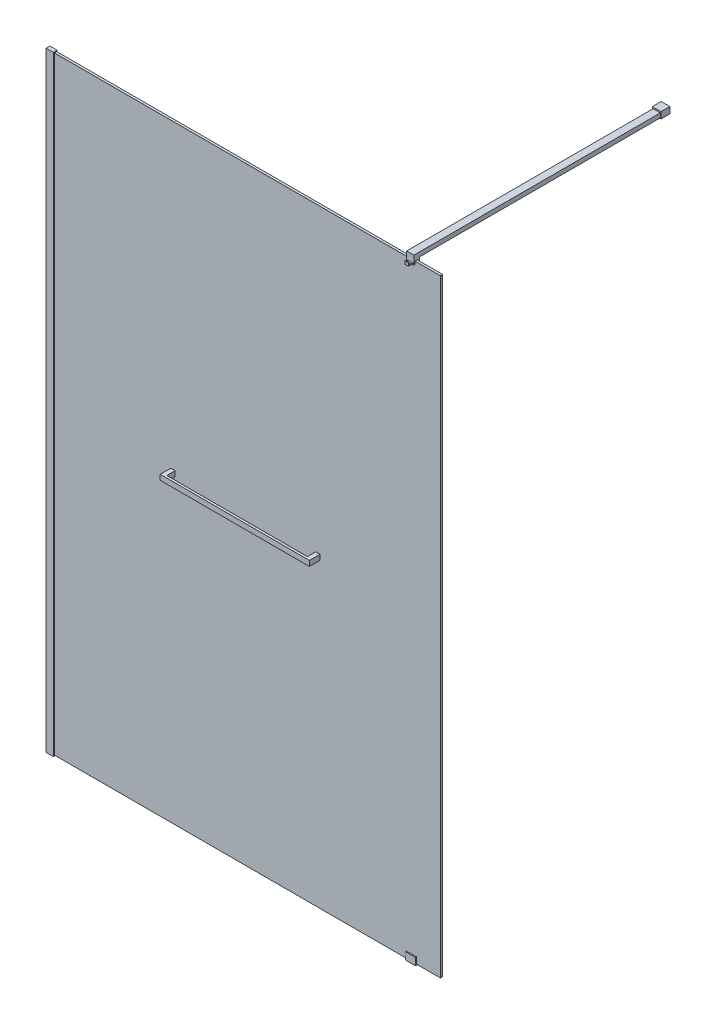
from build123d import *

# Parameters (mm, degrees)
DODANIE_WYCI_GNI_CIE1_DEPTH     = 2100
SZKIC2_W                        = 1347
SZKIC2_H                        = 8
DODANIE_WYCI_GNI_CIE2_DEPTH     = 2100
SZKIC4_W                        = 25
SZKIC4_H                        = 13.3
DODANIE_WYCI_GNI_CIE3_DEPTH     = 3
SZKIC5_W                        = 25
SZKIC5_H                        = 13.3
DODANIE_WYCI_GNI_CIE4_DEPTH     = 3
DODANIE_WYCI_GNI_CIE5_DEPTH     = 17.5
DODANIE_WYCI_GNI_CIE6_DEPTH     = 12.5
WYTNIJ_WYCI_GNI_CIE1_DEPTH      = 2504.671656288
WYTNIJ_WYCI_GNI_CIE1_DEPTH_BACK = 2504.671656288
SZKIC10_W                       = 25
SZKIC10_H                       = 861.63
DODANIE_WYCI_GNI_CIE7_DEPTH     = 15
SZKIC14_W                       = 30
SZKIC14_H                       = 22
DODANIE_WYCI_GNI_CIE8_DEPTH     = 31
POLKA_1A_DEPTH                  = 36.5
POLKA_1A_DEPTH_BACK             = 31
SZKIC17_W                       = 15
SZKIC17_H                       = 18
POLKA_1A_2_DEPTH                = 36.5
POLKA_1A_2_DEPTH_BACK           = 31
POLKA_1B_START                  = -515
SZKIC18_W                       = 12.8
SZKIC18_H                       = 8
POLKA_1B_DEPTH                  = 515
POLKA_1C_START                  = -5.28
SZKIC19_W                       = 515
SZKIC19_H                       = 80
POLKA_1C_DEPTH                  = 8
SZKIC20_W                       = 8
SZKIC20_H                       = 18
POLKA_1D_DEPTH                  = 485


with BuildPart() as part:
    # Szkic1 → Dodanie-wyci_gni_cie1 (new body)
    with BuildSketch(Plane(origin=(0, 0, 0), x_dir=(1, 0, 0), z_dir=(0, 1, 0))):
        Polygon((0, 0), (0, 13.3), (25, 13.3), (25, 11.4), (11.45, 11.4), (11.45, 3.4), (25, 3.4), (25, 0), align=None)
    extrude(amount=DODANIE_WYCI_GNI_CIE1_DEPTH)

    # Szkic4 → Dodanie-wyci_gni_cie3 (add)
    with BuildSketch(Plane(origin=(0, 2100, 0), x_dir=(1, 0, 0), z_dir=(0, 1, 0))):
        with Locations((12.5, 6.65)):
            Rectangle(SZKIC4_W, SZKIC4_H)
    extrude(amount=DODANIE_WYCI_GNI_CIE3_DEPTH)

    # Szkic5 → Dodanie-wyci_gni_cie4 (add)
    with BuildSketch(Plane.XZ):
        with Locations((12.5, -6.65)):
            Rectangle(SZKIC5_W, SZKIC5_H)
    extrude(amount=DODANIE_WYCI_GNI_CIE4_DEPTH)


with BuildPart() as body_2:
    # Szkic2 → Dodanie-wyci_gni_cie2 (new body)
    with BuildSketch(Plane.XZ):
        with Locations((684.95, -7.4)):
            Rectangle(SZKIC2_W, SZKIC2_H)
    extrude(amount=-DODANIE_WYCI_GNI_CIE2_DEPTH)


with BuildPart() as body_3:
    # Szkic6 → Dodanie-wyci_gni_cie5 (new, symmetric)
    with BuildSketch(Plane(origin=(1258.45, 0, 0), x_dir=(0, 0, -1), z_dir=(1, 0, 0))):
        Polygon((11.4, 22), (15.75, 22), (15.75, -3), (-0.35, -3), (-0.35, 22), (3.4, 22), (3.4, 0), (11.4, 0), align=None)
    extrude(amount=DODANIE_WYCI_GNI_CIE5_DEPTH, both=True)


with BuildPart() as body_4:
    # Szkic7 → Dodanie-wyci_gni_cie6 (new, symmetric)
    with BuildSketch(Plane(origin=(1258.45, 0, 0), x_dir=(0, 0, -1), z_dir=(1, 0, 0))):
        Polygon((-0.6, 2120), (19.4, 2120), (19.4, 2090), (11.4, 2090), (11.4, 2100), (3.4, 2100), (3.4, 2090), (-13.37, 2090), (-13.37, 2100), (-10.37, 2100), (-9.845068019, 2094), (-0.6, 2094), align=None)
    extrude(amount=DODANIE_WYCI_GNI_CIE6_DEPTH, both=True)

    # Szkic8 → Wytnij-wyci_gni_cie1 (cut, two sides: drawn at the far end of the back side and taken through both)
    with BuildSketch(Plane(origin=(0, 2100, 0), x_dir=(1, 0, 0), z_dir=(0, 1, 0)).offset(-WYTNIJ_WYCI_GNI_CIE1_DEPTH_BACK)):
        Polygon((-1067.142061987, 1078.012542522), (1245.95, -0.6), (1252.45, -3.630999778), (1252.45, -13.37), (1264.45, -13.37), (1264.45, -3.630999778), (1270.95, -0.6), (3584.042061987, 1078.012542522), (3584.042061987, -4026.416868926), (-1067.142061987, -4026.416868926), align=None)
    extrude(amount=WYTNIJ_WYCI_GNI_CIE1_DEPTH + WYTNIJ_WYCI_GNI_CIE1_DEPTH_BACK, mode=Mode.SUBTRACT)

    # Szkic10 → Dodanie-wyci_gni_cie7 (add)
    with BuildSketch(Plane(origin=(0, 2120, 0), x_dir=(1, 0, 0), z_dir=(0, 1, 0))):
        with Locations((1258.45, 450.215)):
            Rectangle(SZKIC10_W, SZKIC10_H)
    extrude(amount=-DODANIE_WYCI_GNI_CIE7_DEPTH)

    # Szkic14 → Dodanie-wyci_gni_cie8 (add)
    with BuildSketch(Plane(origin=(0, 0, -881.03), x_dir=(-1, 0, 0), z_dir=(0, 0, -1))):
        with Locations((-1258.45, 2114)):
            Rectangle(SZKIC14_W, SZKIC14_H)
    extrude(amount=-DODANIE_WYCI_GNI_CIE8_DEPTH)


with BuildPart() as body_5:
    # Szkic17 → polka_1a (new, two sides: drawn at the far end of the back side and taken through both)
    with BuildSketch(Plane.XY.offset(-3.4).offset(-POLKA_1A_DEPTH_BACK)):
        with Locations((434.95, 1050)):
            Rectangle(SZKIC17_W, SZKIC17_H)
    extrude(amount=POLKA_1A_DEPTH + POLKA_1A_DEPTH_BACK)


with BuildPart() as body_6:
    # Szkic17 → polka_1a 2 (new, two sides: drawn at the far end of the back side and taken through both)
    with BuildSketch(Plane.XY.offset(-3.4).offset(-POLKA_1A_2_DEPTH_BACK)):
        with Locations((934.95, 1050)):
            Rectangle(SZKIC17_W, SZKIC17_H)
    extrude(amount=POLKA_1A_2_DEPTH + POLKA_1A_2_DEPTH_BACK)


with BuildPart() as polka_1b_tool:
    # Szkic18 → polka_1b (new body)
    with BuildSketch(Plane.ZY.offset(-427.45).offset(POLKA_1B_START)):
        with Locations((-28, 1049.73)):
            Rectangle(SZKIC18_W, SZKIC18_H)
    extrude(amount=POLKA_1B_DEPTH)


with BuildPart() as body_5_1:
    add(body_5.part)

    # polka_1b: cut by polka_1b_tool
    add(polka_1b_tool.part, mode=Mode.SUBTRACT)



with BuildPart() as body_6_1:
    add(body_6.part)

    # polka_1b: cut by polka_1b_tool
    add(polka_1b_tool.part, mode=Mode.SUBTRACT)


with BuildPart() as body_7:
    # Szkic19 → polka_1c (new body)
    with BuildSketch(Plane(origin=(0, 1059, 0), x_dir=(1, 0, 0), z_dir=(0, 1, 0)).offset(POLKA_1C_START)):
        with Locations((684.95, 61.6)):
            Rectangle(SZKIC19_W, SZKIC19_H)
    extrude(amount=-POLKA_1C_DEPTH)


with BuildPart() as body_5_2:
    add(body_5_1.part)

    add(body_6_1.part)  # polka_1d merges body 6
    # Szkic20 → polka_1d (add)
    with BuildSketch(Plane(origin=(442.45, 0, 0), x_dir=(0, 0, -1), z_dir=(1, 0, 0))):
        with Locations((-29.1, 1050)):
            Rectangle(SZKIC20_W, SZKIC20_H)
    extrude(amount=POLKA_1D_DEPTH)


solid = Compound([part.part, body_2.part, body_3.part, body_4.part, body_7.part, body_5_2.part])
